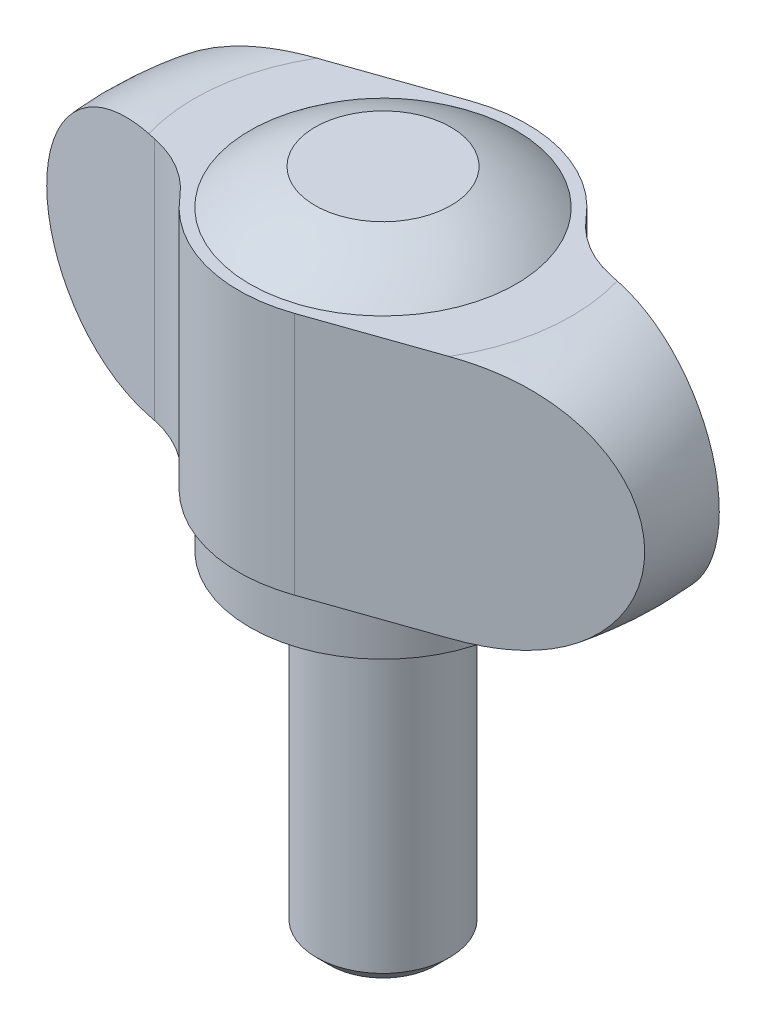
ISO-10303-21;
HEADER;
FILE_DESCRIPTION(('STEP AP214'),'2;1');
FILE_NAME('part.step','',(''),(''),'','','');
FILE_SCHEMA(('AUTOMOTIVE_DESIGN { 1 0 10303 214 1 1 1 1 }'));
ENDSEC;
DATA;
#1=APPLICATION_CONTEXT('core data for automotive mechanical design processes');
#2=APPLICATION_PROTOCOL_DEFINITION('international standard','automotive_design',2000,#1);
#3=PRODUCT_CONTEXT('',#1,'mechanical');
#4=PRODUCT('Part','Part','',(#3));
#5=PRODUCT_RELATED_PRODUCT_CATEGORY('part','',(#4));
#6=PRODUCT_DEFINITION_FORMATION('','',#4);
#7=PRODUCT_DEFINITION_CONTEXT('part definition',#1,'design');
#8=PRODUCT_DEFINITION('design','',#6,#7);
#9=PRODUCT_DEFINITION_SHAPE('','',#8);
#10=(LENGTH_UNIT() NAMED_UNIT(*) SI_UNIT(.MILLI.,.METRE.));
#11=(NAMED_UNIT(*) PLANE_ANGLE_UNIT() SI_UNIT($,.RADIAN.));
#12=(NAMED_UNIT(*) SI_UNIT($,.STERADIAN.) SOLID_ANGLE_UNIT());
#13=UNCERTAINTY_MEASURE_WITH_UNIT(LENGTH_MEASURE(1.E-05),#10,'distance_accuracy_value','');
#14=(GEOMETRIC_REPRESENTATION_CONTEXT(3) GLOBAL_UNCERTAINTY_ASSIGNED_CONTEXT((#13)) GLOBAL_UNIT_ASSIGNED_CONTEXT((#10,
#11,#12)) REPRESENTATION_CONTEXT('',''));
#15=CARTESIAN_POINT('',(0.,0.,0.));
#16=DIRECTION('',(0.,0.,1.));
#17=DIRECTION('',(1.,0.,0.));
#18=AXIS2_PLACEMENT_3D('',#15,#16,#17);
#19=CARTESIAN_POINT('',(0.,15.,0.));
#20=DIRECTION('',(0.,-1.,0.));
#21=DIRECTION('',(0.,0.,-1.));
#22=AXIS2_PLACEMENT_3D('',#19,#20,#21);
#23=PLANE('',#22);
#24=CARTESIAN_POINT('',(0.,15.,0.));
#25=DIRECTION('',(0.,-1.,0.));
#26=DIRECTION('',(0.,0.,-1.));
#27=AXIS2_PLACEMENT_3D('',#24,#25,#26);
#28=CIRCLE('',#27,3.06127891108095);
#29=CARTESIAN_POINT('',(0.,15.,-3.06127891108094));
#30=VERTEX_POINT('',#29);
#31=EDGE_CURVE('E21',#30,#30,#28,.T.);
#32=ORIENTED_EDGE('',*,*,#31,.F.);
#33=EDGE_LOOP('',(#32));
#34=FACE_BOUND('',#33,.T.);
#35=ADVANCED_FACE('F16',(#34),#23,.F.);
#36=CARTESIAN_POINT('',(0.,5.87857142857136,0.));
#37=DIRECTION('',(1.,0.,0.));
#38=DIRECTION('',(0.,0.776661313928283,-0.629918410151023));
#39=AXIS2_PLACEMENT_3D('',#36,#37,#38);
#40=SPHERICAL_SURFACE('',#39,9.62142857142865);
#41=CARTESIAN_POINT('',(0.,5.87857142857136,0.));
#42=DIRECTION('',(0.,-1.,0.));
#43=DIRECTION('',(0.,0.,-1.));
#44=AXIS2_PLACEMENT_3D('',#41,#42,#43);
#45=SPHERICAL_SURFACE('',#44,9.62142857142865);
#46=ORIENTED_EDGE('',*,*,#31,.T.);
#47=EDGE_LOOP('',(#46));
#48=FACE_BOUND('',#47,.T.);
#49=CARTESIAN_POINT('',(0.,13.4,0.));
#50=DIRECTION('',(0.,-1.,0.));
#51=DIRECTION('',(0.,0.,-1.));
#52=AXIS2_PLACEMENT_3D('',#49,#50,#51);
#53=CIRCLE('',#52,6.00000000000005);
#54=CARTESIAN_POINT('',(0.,13.4,-6.00000000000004));
#55=VERTEX_POINT('',#54);
#56=EDGE_CURVE('E114',#55,#55,#53,.F.);
#57=ORIENTED_EDGE('',*,*,#56,.T.);
#58=EDGE_LOOP('',(#57));
#59=FACE_BOUND('',#58,.T.);
#60=ADVANCED_FACE('F187',(#48,#59),#45,.T.);
#61=CARTESIAN_POINT('',(-14.,20.,1.2));
#62=DIRECTION('',(0.201762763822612,0.,-0.979434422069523));
#63=DIRECTION('',(-0.979434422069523,0.,-0.201762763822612));
#64=AXIS2_PLACEMENT_3D('',#61,#62,#63);
#65=PLANE('',#64);
#66=DIRECTION('',(0.,1.,0.));
#67=VECTOR('',#66,1.);
#68=CARTESIAN_POINT('',(-7.81873445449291,20.,2.47333611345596));
#69=LINE('',#68,#67);
#70=CARTESIAN_POINT('',(-7.81873445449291,2.39999999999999,2.47333611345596));
#71=VERTEX_POINT('',#70);
#72=CARTESIAN_POINT('',(-7.81873445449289,13.4,2.47333611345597));
#73=VERTEX_POINT('',#72);
#74=EDGE_CURVE('E132',#71,#73,#69,.T.);
#75=ORIENTED_EDGE('',*,*,#74,.T.);
#76=DIRECTION('',(-0.979434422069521,0.,-0.201762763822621));
#77=VECTOR('',#76,1.);
#78=CARTESIAN_POINT('',(-7.81873445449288,13.4,2.47333611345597));
#79=LINE('',#78,#77);
#80=CARTESIAN_POINT('',(-8.15280922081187,13.4,2.4045169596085));
#81=VERTEX_POINT('',#80);
#82=EDGE_CURVE('E113',#73,#81,#79,.T.);
#83=ORIENTED_EDGE('',*,*,#82,.T.);
#84=CARTESIAN_POINT('',(-8.15280922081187,2.4,2.4045169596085));
#85=CARTESIAN_POINT('',(-8.32890758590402,2.39997095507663,2.36824082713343));
#86=CARTESIAN_POINT('',(-8.50505324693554,2.40686424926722,2.33195495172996));
#87=CARTESIAN_POINT('',(-8.85634674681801,2.43495780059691,2.25958875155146));
#88=CARTESIAN_POINT('',(-9.03149391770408,2.45616670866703,2.22350856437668));
#89=CARTESIAN_POINT('',(-9.38017575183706,2.51346890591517,2.15168036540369));
#90=CARTESIAN_POINT('',(-9.55370120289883,2.54962119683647,2.11593425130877));
#91=CARTESIAN_POINT('',(-9.89703709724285,2.63704156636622,2.04520731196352));
#92=CARTESIAN_POINT('',(-10.0668482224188,2.68830684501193,2.01022634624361));
#93=CARTESIAN_POINT('',(-10.4048509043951,2.80723958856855,1.94059804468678));
#94=CARTESIAN_POINT('',(-10.5729350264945,2.87522650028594,1.90597284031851));
#95=CARTESIAN_POINT('',(-10.9021926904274,3.02684903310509,1.83814600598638));
#96=CARTESIAN_POINT('',(-11.063366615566,3.11048378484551,1.80494429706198));
#97=CARTESIAN_POINT('',(-11.3768919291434,3.29282968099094,1.74035831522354));
#98=CARTESIAN_POINT('',(-11.5292605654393,3.39150987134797,1.70897048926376));
#99=CARTESIAN_POINT('',(-11.8239293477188,3.60344897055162,1.64826893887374));
#100=CARTESIAN_POINT('',(-11.966230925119,3.7167058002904,1.61895491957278));
#101=CARTESIAN_POINT('',(-12.2245436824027,3.94402585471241,1.56574268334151));
#102=CARTESIAN_POINT('',(-12.3417364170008,4.05669245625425,1.54160106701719));
#103=CARTESIAN_POINT('',(-12.5658403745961,4.29221860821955,1.49543581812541));
#104=CARTESIAN_POINT('',(-12.6727525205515,4.41507724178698,1.47341199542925));
#105=CARTESIAN_POINT('',(-12.875382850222,4.67019439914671,1.43167029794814));
#106=CARTESIAN_POINT('',(-12.971094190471,4.80245859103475,1.41195383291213));
#107=CARTESIAN_POINT('',(-13.1503468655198,5.07531815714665,1.37502791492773));
#108=CARTESIAN_POINT('',(-13.233888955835,5.21591301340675,1.35781830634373));
#109=CARTESIAN_POINT('',(-13.3833301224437,5.49556809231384,1.32703353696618));
#110=CARTESIAN_POINT('',(-13.4499920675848,5.63420396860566,1.31330122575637));
#111=CARTESIAN_POINT('',(-13.5713060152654,5.91684392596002,1.2883106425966));
#112=CARTESIAN_POINT('',(-13.6259588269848,6.0608476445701,1.27705220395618));
#113=CARTESIAN_POINT('',(-13.7226918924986,6.35288469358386,1.25712526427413));
#114=CARTESIAN_POINT('',(-13.7647959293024,6.50090981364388,1.24845186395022));
#115=CARTESIAN_POINT('',(-13.8361905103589,6.80008784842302,1.23374463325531));
#116=CARTESIAN_POINT('',(-13.8654864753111,6.95123941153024,1.22770968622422));
#117=CARTESIAN_POINT('',(-13.9079778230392,7.23514887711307,1.21895650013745));
#118=CARTESIAN_POINT('',(-13.9228056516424,7.36765475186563,1.21590197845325));
#119=CARTESIAN_POINT('',(-13.9425884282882,7.63343839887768,1.21182674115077));
#120=CARTESIAN_POINT('',(-13.9475430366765,7.76671619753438,1.21080609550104));
#121=CARTESIAN_POINT('',(-13.9475424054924,8.04913209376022,1.21080622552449));
#122=CARTESIAN_POINT('',(-13.9413387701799,8.19827170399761,1.21208416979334));
#123=CARTESIAN_POINT('',(-13.9165698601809,8.4955320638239,1.21718654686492));
#124=CARTESIAN_POINT('',(-13.8979996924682,8.64365238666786,1.22101198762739));
#125=CARTESIAN_POINT('',(-13.8486139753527,8.93795149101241,1.23118540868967));
#126=CARTESIAN_POINT('',(-13.8177822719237,9.08412744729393,1.23753671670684));
#127=CARTESIAN_POINT('',(-13.7441140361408,9.37334850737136,1.25271231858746));
#128=CARTESIAN_POINT('',(-13.7012729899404,9.51639241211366,1.26153754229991));
#129=CARTESIAN_POINT('',(-13.6040240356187,9.79804873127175,1.28157075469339));
#130=CARTESIAN_POINT('',(-13.5496356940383,9.9366681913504,1.29277471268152));
#131=CARTESIAN_POINT('',(-13.4296675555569,10.2088225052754,1.31748806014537));
#132=CARTESIAN_POINT('',(-13.3640836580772,10.3423554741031,1.33099829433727));
#133=CARTESIAN_POINT('',(-13.2223087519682,10.6033016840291,1.36020381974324));
#134=CARTESIAN_POINT('',(-13.1461245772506,10.7307187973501,1.37589770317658));
#135=CARTESIAN_POINT('',(-12.9836891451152,10.9787400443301,1.40935928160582));
#136=CARTESIAN_POINT('',(-12.8974343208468,11.0993417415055,1.42712771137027));
#137=CARTESIAN_POINT('',(-12.7144110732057,11.3343890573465,1.46483036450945));
#138=CARTESIAN_POINT('',(-12.617524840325,11.448739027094,1.48478885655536));
#139=CARTESIAN_POINT('',(-12.4148906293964,11.6689396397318,1.52653135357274));
#140=CARTESIAN_POINT('',(-12.3091423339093,11.774789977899,1.54831542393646));
#141=CARTESIAN_POINT('',(-12.0895944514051,11.9773811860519,1.59354212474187));
#142=CARTESIAN_POINT('',(-11.9757951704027,12.0741224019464,1.61698469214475));
#143=CARTESIAN_POINT('',(-11.7410175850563,12.2579691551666,1.66534870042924));
#144=CARTESIAN_POINT('',(-11.6200412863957,12.3450773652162,1.69026972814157));
#145=CARTESIAN_POINT('',(-11.3670538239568,12.5123896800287,1.74238495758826));
#146=CARTESIAN_POINT('',(-11.2347984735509,12.592208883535,1.76962946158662));
#147=CARTESIAN_POINT('',(-10.9644781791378,12.7407151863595,1.82531524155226));
#148=CARTESIAN_POINT('',(-10.8264148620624,12.8094053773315,1.85375618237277));
#149=CARTESIAN_POINT('',(-10.5452531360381,12.9355459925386,1.91167528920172));
#150=CARTESIAN_POINT('',(-10.402148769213,12.9929825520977,1.94115468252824));
#151=CARTESIAN_POINT('',(-10.112076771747,13.0964001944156,2.00090929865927));
#152=CARTESIAN_POINT('',(-9.96511033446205,13.1423847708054,2.03118427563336));
#153=CARTESIAN_POINT('',(-9.68099065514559,13.2194752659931,2.08971271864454));
#154=CARTESIAN_POINT('',(-9.54408039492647,13.2515206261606,2.11791613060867));
#155=CARTESIAN_POINT('',(-9.26846219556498,13.3061775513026,2.17469327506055));
#156=CARTESIAN_POINT('',(-9.12975418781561,13.3287887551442,2.20326702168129));
#157=CARTESIAN_POINT('',(-8.85158886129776,13.3646898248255,2.26056887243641));
#158=CARTESIAN_POINT('',(-8.71213471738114,13.378005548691,2.28929632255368));
#159=CARTESIAN_POINT('',(-8.4327169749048,13.3956650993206,2.34685617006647));
#160=CARTESIAN_POINT('',(-8.2927535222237,13.4000113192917,2.37568853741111));
#161=CARTESIAN_POINT('',(-8.15280922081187,13.4,2.4045169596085));
#162=B_SPLINE_CURVE_WITH_KNOTS('',3,(#84,#85,#86,#87,#88,#89,#90,#91,#92,#93,#94,#95,#96,#97,
#98,#99,#100,#101,#102,#103,#104,#105,#106,#107,#108,#109,#110,#111,#112,#113,#114,#115,#116,
#117,#118,#119,#120,#121,#122,#123,#124,#125,#126,#127,#128,#129,#130,#131,#132,#133,#134,#135,
#136,#137,#138,#139,#140,#141,#142,#143,#144,#145,#146,#147,#148,#149,#150,#151,#152,#153,#154,
#155,#156,#157,#158,#159,#160,#161),.UNSPECIFIED.,.F.,.F.,(4,2,2,2,2,2,2,2,2,2,2,2,2,2,2,2,2,2,
2,2,2,2,2,2,2,2,2,2,2,2,2,2,2,2,2,2,2,2,4),(0.,0.539326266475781,1.07897874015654,
1.62078261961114,2.16248618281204,2.71547467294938,3.26843244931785,3.82026756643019,
4.37202406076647,4.86444235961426,5.35681640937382,5.84948973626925,6.34213246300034,
6.80488832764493,7.26761300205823,7.72945503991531,8.19110142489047,8.59083086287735,
8.99057405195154,9.43784924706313,9.88530151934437,10.3333452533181,10.781557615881,
11.229016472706,11.6766395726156,12.1239754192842,12.571470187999,13.0245515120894,
13.4776490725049,13.9307294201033,14.3836837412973,14.8537416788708,15.3236688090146,
15.7941713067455,16.2645300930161,16.6944394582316,17.1243652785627,17.5530903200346,
17.9817009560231),.UNSPECIFIED.);
#163=CARTESIAN_POINT('',(-8.15280922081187,2.4,2.4045169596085));
#164=VERTEX_POINT('',#163);
#165=EDGE_CURVE('E191',#164,#81,#162,.T.);
#166=ORIENTED_EDGE('',*,*,#165,.F.);
#167=DIRECTION('',(-0.979434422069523,0.,-0.201762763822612));
#168=VECTOR('',#167,1.);
#169=CARTESIAN_POINT('',(-14.,2.39999999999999,1.2));
#170=LINE('',#169,#168);
#171=EDGE_CURVE('E143',#71,#164,#170,.T.);
#172=ORIENTED_EDGE('',*,*,#171,.F.);
#173=EDGE_LOOP('',(#75,#83,#166,#172));
#174=FACE_BOUND('',#173,.T.);
#175=ADVANCED_FACE('F199',(#174),#65,.F.);
#176=CARTESIAN_POINT('',(14.,20.,-1.2));
#177=DIRECTION('',(-0.201762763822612,0.,0.979434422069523));
#178=DIRECTION('',(0.979434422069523,0.,0.201762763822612));
#179=AXIS2_PLACEMENT_3D('',#176,#177,#178);
#180=PLANE('',#179);
#181=DIRECTION('',(0.,1.,0.));
#182=VECTOR('',#181,1.);
#183=CARTESIAN_POINT('',(7.81873445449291,20.,-2.47333611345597));
#184=LINE('',#183,#182);
#185=CARTESIAN_POINT('',(7.81873445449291,2.39999999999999,-2.47333611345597));
#186=VERTEX_POINT('',#185);
#187=CARTESIAN_POINT('',(7.81873445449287,13.4,-2.47333611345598));
#188=VERTEX_POINT('',#187);
#189=EDGE_CURVE('E126',#186,#188,#184,.T.);
#190=ORIENTED_EDGE('',*,*,#189,.T.);
#191=DIRECTION('',(0.97943442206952,0.,0.201762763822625));
#192=VECTOR('',#191,1.);
#193=CARTESIAN_POINT('',(7.81873445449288,13.4,-2.47333611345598));
#194=LINE('',#193,#192);
#195=CARTESIAN_POINT('',(8.15280922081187,13.4,-2.4045169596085));
#196=VERTEX_POINT('',#195);
#197=EDGE_CURVE('E136',#188,#196,#194,.T.);
#198=ORIENTED_EDGE('',*,*,#197,.T.);
#199=CARTESIAN_POINT('',(8.15280922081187,2.4,-2.4045169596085));
#200=CARTESIAN_POINT('',(8.32890758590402,2.39997095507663,-2.36824082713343));
#201=CARTESIAN_POINT('',(8.50505324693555,2.40686424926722,-2.33195495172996));
#202=CARTESIAN_POINT('',(8.85634674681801,2.43495780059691,-2.25958875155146));
#203=CARTESIAN_POINT('',(9.03149391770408,2.45616670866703,-2.22350856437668));
#204=CARTESIAN_POINT('',(9.38017575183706,2.51346890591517,-2.15168036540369));
#205=CARTESIAN_POINT('',(9.55370120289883,2.54962119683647,-2.11593425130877));
#206=CARTESIAN_POINT('',(9.89703709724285,2.63704156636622,-2.04520731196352));
#207=CARTESIAN_POINT('',(10.0668482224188,2.68830684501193,-2.01022634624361));
#208=CARTESIAN_POINT('',(10.4048509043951,2.80723958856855,-1.94059804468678));
#209=CARTESIAN_POINT('',(10.5729350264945,2.87522650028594,-1.90597284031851));
#210=CARTESIAN_POINT('',(10.9021926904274,3.02684903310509,-1.83814600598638));
#211=CARTESIAN_POINT('',(11.063366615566,3.11048378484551,-1.80494429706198));
#212=CARTESIAN_POINT('',(11.3768919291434,3.29282968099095,-1.74035831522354));
#213=CARTESIAN_POINT('',(11.5292605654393,3.39150987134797,-1.70897048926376));
#214=CARTESIAN_POINT('',(11.8239293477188,3.60344897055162,-1.64826893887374));
#215=CARTESIAN_POINT('',(11.966230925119,3.7167058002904,-1.61895491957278));
#216=CARTESIAN_POINT('',(12.2245436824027,3.9440258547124,-1.56574268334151));
#217=CARTESIAN_POINT('',(12.3417364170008,4.05669245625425,-1.54160106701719));
#218=CARTESIAN_POINT('',(12.5658403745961,4.29221860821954,-1.49543581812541));
#219=CARTESIAN_POINT('',(12.6727525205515,4.41507724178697,-1.47341199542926));
#220=CARTESIAN_POINT('',(12.875382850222,4.67019439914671,-1.43167029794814));
#221=CARTESIAN_POINT('',(12.971094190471,4.80245859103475,-1.41195383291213));
#222=CARTESIAN_POINT('',(13.1503468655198,5.07531815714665,-1.37502791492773));
#223=CARTESIAN_POINT('',(13.233888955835,5.21591301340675,-1.35781830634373));
#224=CARTESIAN_POINT('',(13.3833301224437,5.49556809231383,-1.32703353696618));
#225=CARTESIAN_POINT('',(13.4499920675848,5.63420396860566,-1.31330122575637));
#226=CARTESIAN_POINT('',(13.5713060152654,5.91684392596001,-1.2883106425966));
#227=CARTESIAN_POINT('',(13.6259588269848,6.0608476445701,-1.27705220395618));
#228=CARTESIAN_POINT('',(13.7226918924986,6.35288469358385,-1.25712526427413));
#229=CARTESIAN_POINT('',(13.7647959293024,6.50090981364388,-1.24845186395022));
#230=CARTESIAN_POINT('',(13.8361905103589,6.80008784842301,-1.23374463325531));
#231=CARTESIAN_POINT('',(13.8654864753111,6.95123941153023,-1.22770968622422));
#232=CARTESIAN_POINT('',(13.9079778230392,7.23514887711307,-1.21895650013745));
#233=CARTESIAN_POINT('',(13.9228056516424,7.36765475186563,-1.21590197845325));
#234=CARTESIAN_POINT('',(13.9425884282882,7.63343839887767,-1.21182674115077));
#235=CARTESIAN_POINT('',(13.9475430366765,7.76671619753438,-1.21080609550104));
#236=CARTESIAN_POINT('',(13.9475424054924,8.04913209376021,-1.21080622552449));
#237=CARTESIAN_POINT('',(13.9413387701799,8.19827170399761,-1.21208416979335));
#238=CARTESIAN_POINT('',(13.9165698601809,8.4955320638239,-1.21718654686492));
#239=CARTESIAN_POINT('',(13.8979996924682,8.64365238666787,-1.2210119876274));
#240=CARTESIAN_POINT('',(13.8486139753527,8.93795149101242,-1.23118540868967));
#241=CARTESIAN_POINT('',(13.8177822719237,9.08412744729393,-1.23753671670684));
#242=CARTESIAN_POINT('',(13.7441140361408,9.37334850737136,-1.25271231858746));
#243=CARTESIAN_POINT('',(13.7012729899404,9.51639241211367,-1.26153754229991));
#244=CARTESIAN_POINT('',(13.6040240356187,9.79804873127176,-1.28157075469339));
#245=CARTESIAN_POINT('',(13.5496356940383,9.9366681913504,-1.29277471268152));
#246=CARTESIAN_POINT('',(13.4296675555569,10.2088225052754,-1.31748806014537));
#247=CARTESIAN_POINT('',(13.3640836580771,10.3423554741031,-1.33099829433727));
#248=CARTESIAN_POINT('',(13.2223087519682,10.6033016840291,-1.36020381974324));
#249=CARTESIAN_POINT('',(13.1461245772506,10.7307187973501,-1.37589770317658));
#250=CARTESIAN_POINT('',(12.9836891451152,10.9787400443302,-1.40935928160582));
#251=CARTESIAN_POINT('',(12.8974343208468,11.0993417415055,-1.42712771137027));
#252=CARTESIAN_POINT('',(12.7144110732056,11.3343890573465,-1.46483036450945));
#253=CARTESIAN_POINT('',(12.617524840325,11.448739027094,-1.48478885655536));
#254=CARTESIAN_POINT('',(12.4148906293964,11.6689396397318,-1.52653135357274));
#255=CARTESIAN_POINT('',(12.3091423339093,11.774789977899,-1.54831542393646));
#256=CARTESIAN_POINT('',(12.0895944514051,11.9773811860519,-1.59354212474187));
#257=CARTESIAN_POINT('',(11.9757951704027,12.0741224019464,-1.61698469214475));
#258=CARTESIAN_POINT('',(11.7410175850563,12.2579691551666,-1.66534870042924));
#259=CARTESIAN_POINT('',(11.6200412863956,12.3450773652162,-1.69026972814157));
#260=CARTESIAN_POINT('',(11.3670538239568,12.5123896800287,-1.74238495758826));
#261=CARTESIAN_POINT('',(11.2347984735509,12.592208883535,-1.76962946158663));
#262=CARTESIAN_POINT('',(10.9644781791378,12.7407151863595,-1.82531524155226));
#263=CARTESIAN_POINT('',(10.8264148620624,12.8094053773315,-1.85375618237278));
#264=CARTESIAN_POINT('',(10.5452531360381,12.9355459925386,-1.91167528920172));
#265=CARTESIAN_POINT('',(10.402148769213,12.9929825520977,-1.94115468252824));
#266=CARTESIAN_POINT('',(10.112076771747,13.0964001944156,-2.00090929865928));
#267=CARTESIAN_POINT('',(9.96511033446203,13.1423847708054,-2.03118427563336));
#268=CARTESIAN_POINT('',(9.68099065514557,13.2194752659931,-2.08971271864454));
#269=CARTESIAN_POINT('',(9.54408039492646,13.2515206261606,-2.11791613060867));
#270=CARTESIAN_POINT('',(9.26846219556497,13.3061775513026,-2.17469327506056));
#271=CARTESIAN_POINT('',(9.1297541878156,13.3287887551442,-2.20326702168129));
#272=CARTESIAN_POINT('',(8.85158886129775,13.3646898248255,-2.26056887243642));
#273=CARTESIAN_POINT('',(8.71213471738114,13.378005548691,-2.28929632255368));
#274=CARTESIAN_POINT('',(8.4327169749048,13.3956650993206,-2.34685617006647));
#275=CARTESIAN_POINT('',(8.2927535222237,13.4000113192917,-2.37568853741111));
#276=CARTESIAN_POINT('',(8.15280922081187,13.4,-2.4045169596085));
#277=B_SPLINE_CURVE_WITH_KNOTS('',3,(#199,#200,#201,#202,#203,#204,#205,#206,#207,#208,#209,
#210,#211,#212,#213,#214,#215,#216,#217,#218,#219,#220,#221,#222,#223,#224,#225,#226,#227,#228,
#229,#230,#231,#232,#233,#234,#235,#236,#237,#238,#239,#240,#241,#242,#243,#244,#245,#246,#247,
#248,#249,#250,#251,#252,#253,#254,#255,#256,#257,#258,#259,#260,#261,#262,#263,#264,#265,#266,
#267,#268,#269,#270,#271,#272,#273,#274,#275,#276),.UNSPECIFIED.,.F.,.F.,(4,2,2,2,2,2,2,2,2,2,2,
2,2,2,2,2,2,2,2,2,2,2,2,2,2,2,2,2,2,2,2,2,2,2,2,2,2,2,4),(0.,0.539326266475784,1.07897874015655,
1.62078261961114,2.16248618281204,2.71547467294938,3.26843244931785,3.82026756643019,
4.37202406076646,4.86444235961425,5.35681640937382,5.84948973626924,6.34213246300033,
6.80488832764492,7.26761300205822,7.7294550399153,8.19110142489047,8.59083086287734,
8.99057405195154,9.43784924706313,9.88530151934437,10.3333452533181,10.781557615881,
11.229016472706,11.6766395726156,12.1239754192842,12.571470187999,13.0245515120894,
13.4776490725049,13.9307294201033,14.3836837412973,14.8537416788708,15.3236688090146,
15.7941713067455,16.2645300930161,16.6944394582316,17.1243652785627,17.5530903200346,
17.981700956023),.UNSPECIFIED.);
#278=CARTESIAN_POINT('',(8.15280922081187,2.4,-2.4045169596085));
#279=VERTEX_POINT('',#278);
#280=EDGE_CURVE('E105',#279,#196,#277,.T.);
#281=ORIENTED_EDGE('',*,*,#280,.F.);
#282=DIRECTION('',(0.979434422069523,0.,0.201762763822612));
#283=VECTOR('',#282,1.);
#284=CARTESIAN_POINT('',(14.,2.39999999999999,-1.2));
#285=LINE('',#284,#283);
#286=EDGE_CURVE('E141',#186,#279,#285,.T.);
#287=ORIENTED_EDGE('',*,*,#286,.F.);
#288=EDGE_LOOP('',(#190,#198,#281,#287));
#289=FACE_BOUND('',#288,.T.);
#290=ADVANCED_FACE('F203',(#289),#180,.F.);
#291=CARTESIAN_POINT('',(6.00000000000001,13.4,0.));
#292=DIRECTION('',(0.,-1.,0.));
#293=DIRECTION('',(0.,0.,-1.));
#294=AXIS2_PLACEMENT_3D('',#291,#292,#293);
#295=PLANE('',#294);
#296=CARTESIAN_POINT('',(8.82754827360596,13.4,-7.37050822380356));
#297=DIRECTION('',(0.,1.,0.));
#298=DIRECTION('',(0.,0.,1.));
#299=AXIS2_PLACEMENT_3D('',#296,#297,#298);
#300=CIRCLE('',#299,4.99999999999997);
#301=CARTESIAN_POINT('',(4.98948380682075,13.4,-4.16593943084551));
#302=VERTEX_POINT('',#301);
#303=EDGE_CURVE('E104',#188,#302,#300,.F.);
#304=ORIENTED_EDGE('',*,*,#303,.T.);
#305=CARTESIAN_POINT('',(0.,13.4,0.));
#306=DIRECTION('',(0.,1.,0.));
#307=DIRECTION('',(0.,0.,1.));
#308=AXIS2_PLACEMENT_3D('',#305,#306,#307);
#309=CIRCLE('',#308,6.49999999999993);
#310=CARTESIAN_POINT('',(-2.14110931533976,13.4,-6.13723479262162));
#311=VERTEX_POINT('',#310);
#312=EDGE_CURVE('E175',#311,#302,#309,.F.);
#313=ORIENTED_EDGE('',*,*,#312,.F.);
#314=DIRECTION('',(0.944189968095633,0.,-0.329401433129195));
#315=VECTOR('',#314,1.);
#316=CARTESIAN_POINT('',(-2.14110931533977,13.4,-6.13723479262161));
#317=LINE('',#316,#315);
#318=CARTESIAN_POINT('',(-7.31265075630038,13.4,-4.33302883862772));
#319=VERTEX_POINT('',#318);
#320=EDGE_CURVE('E174',#311,#319,#317,.F.);
#321=ORIENTED_EDGE('',*,*,#320,.T.);
#322=CARTESIAN_POINT('',(0.,13.4,0.));
#323=DIRECTION('',(0.,-1.,0.));
#324=DIRECTION('',(0.,0.,-1.));
#325=AXIS2_PLACEMENT_3D('',#322,#323,#324);
#326=CIRCLE('',#325,8.5);
#327=EDGE_CURVE('E138',#81,#319,#326,.T.);
#328=ORIENTED_EDGE('',*,*,#327,.F.);
#329=ORIENTED_EDGE('',*,*,#82,.F.);
#330=CARTESIAN_POINT('',(-8.82754827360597,13.4,7.37050822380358));
#331=DIRECTION('',(0.,1.,0.));
#332=DIRECTION('',(0.,0.,1.));
#333=AXIS2_PLACEMENT_3D('',#330,#331,#332);
#334=CIRCLE('',#333,5.);
#335=CARTESIAN_POINT('',(-4.98948380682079,13.4,4.1659394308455));
#336=VERTEX_POINT('',#335);
#337=EDGE_CURVE('E135',#73,#336,#334,.F.);
#338=ORIENTED_EDGE('',*,*,#337,.T.);
#339=CARTESIAN_POINT('',(0.,13.4,0.));
#340=DIRECTION('',(0.,1.,0.));
#341=DIRECTION('',(0.,0.,1.));
#342=AXIS2_PLACEMENT_3D('',#339,#340,#341);
#343=CIRCLE('',#342,6.50000000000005);
#344=CARTESIAN_POINT('',(2.14110931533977,13.4,6.13723479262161));
#345=VERTEX_POINT('',#344);
#346=EDGE_CURVE('E119',#345,#336,#343,.F.);
#347=ORIENTED_EDGE('',*,*,#346,.F.);
#348=DIRECTION('',(-0.944189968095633,0.,0.329401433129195));
#349=VECTOR('',#348,1.);
#350=CARTESIAN_POINT('',(2.14110931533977,13.4,6.13723479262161));
#351=LINE('',#350,#349);
#352=CARTESIAN_POINT('',(7.31265075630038,13.4,4.33302883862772));
#353=VERTEX_POINT('',#352);
#354=EDGE_CURVE('E98',#345,#353,#351,.F.);
#355=ORIENTED_EDGE('',*,*,#354,.T.);
#356=CARTESIAN_POINT('',(0.,13.4,0.));
#357=DIRECTION('',(0.,-1.,0.));
#358=DIRECTION('',(0.,0.,-1.));
#359=AXIS2_PLACEMENT_3D('',#356,#357,#358);
#360=CIRCLE('',#359,8.49999999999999);
#361=EDGE_CURVE('E109',#196,#353,#360,.T.);
#362=ORIENTED_EDGE('',*,*,#361,.F.);
#363=ORIENTED_EDGE('',*,*,#197,.F.);
#364=EDGE_LOOP('',(#304,#313,#321,#328,#329,#338,#347,#355,#362,#363));
#365=FACE_BOUND('',#364,.T.);
#366=ORIENTED_EDGE('',*,*,#56,.F.);
#367=EDGE_LOOP('',(#366));
#368=FACE_BOUND('',#367,.T.);
#369=ADVANCED_FACE('F116',(#365,#368),#295,.F.);
#370=CARTESIAN_POINT('',(0.,7.9,0.));
#371=DIRECTION('',(0.,-1.,0.));
#372=DIRECTION('',(0.,0.,-1.));
#373=AXIS2_PLACEMENT_3D('',#370,#371,#372);
#374=TOROIDAL_SURFACE('',#373,8.49999999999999,5.5);
#375=CARTESIAN_POINT('',(-7.31265075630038,13.4,-4.33302883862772));
#376=CARTESIAN_POINT('',(-7.44554591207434,13.4000031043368,-4.28666544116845));
#377=CARTESIAN_POINT('',(-7.57844074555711,13.3977552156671,-4.24030215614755));
#378=CARTESIAN_POINT('',(-7.84412202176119,13.3881849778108,-4.14761340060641));
#379=CARTESIAN_POINT('',(-7.97690839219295,13.3808604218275,-4.10128795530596));
#380=CARTESIAN_POINT('',(-8.37585784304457,13.3503315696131,-3.9621056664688));
#381=CARTESIAN_POINT('',(-8.64151740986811,13.3185624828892,-3.86942448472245));
#382=CARTESIAN_POINT('',(-9.17128231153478,13.22784118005,-3.68460434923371));
#383=CARTESIAN_POINT('',(-9.43535033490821,13.1686393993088,-3.592478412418));
#384=CARTESIAN_POINT('',(-9.95537368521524,13.0197792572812,-3.411056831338));
#385=CARTESIAN_POINT('',(-10.2113442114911,12.9301821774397,-3.32175588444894));
#386=CARTESIAN_POINT('',(-10.6089106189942,12.7616223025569,-3.18305610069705));
#387=CARTESIAN_POINT('',(-10.7545543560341,12.6932401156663,-3.13224508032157));
#388=CARTESIAN_POINT('',(-11.0404790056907,12.5447817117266,-3.03249397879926));
#389=CARTESIAN_POINT('',(-11.1807595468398,12.4647046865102,-2.98355402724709));
#390=CARTESIAN_POINT('',(-11.4542283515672,12.2931036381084,-2.88814842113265));
#391=CARTESIAN_POINT('',(-11.5874414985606,12.2016241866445,-2.84167408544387));
#392=CARTESIAN_POINT('',(-11.846119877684,12.0070880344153,-2.75142844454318));
#393=CARTESIAN_POINT('',(-11.9715853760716,11.9040317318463,-2.70765704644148));
#394=CARTESIAN_POINT('',(-12.2144656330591,11.6857874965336,-2.62292292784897));
#395=CARTESIAN_POINT('',(-12.3318088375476,11.5705100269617,-2.58198517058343));
#396=CARTESIAN_POINT('',(-12.5560316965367,11.3290542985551,-2.50376009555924));
#397=CARTESIAN_POINT('',(-12.662912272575,11.2028770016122,-2.46647245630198));
#398=CARTESIAN_POINT('',(-12.865075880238,10.9402165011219,-2.39594323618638));
#399=CARTESIAN_POINT('',(-12.9603440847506,10.8037204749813,-2.36270682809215));
#400=CARTESIAN_POINT('',(-13.1379043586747,10.5215761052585,-2.30076102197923));
#401=CARTESIAN_POINT('',(-13.2201984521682,10.3759291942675,-2.27205091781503));
#402=CARTESIAN_POINT('',(-13.3630089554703,10.0920333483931,-2.22222833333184));
#403=CARTESIAN_POINT('',(-13.4248925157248,9.95455422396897,-2.20063889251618));
#404=CARTESIAN_POINT('',(-13.5366341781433,9.67422681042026,-2.16165535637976));
#405=CARTESIAN_POINT('',(-13.5864938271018,9.53137921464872,-2.14426072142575));
#406=CARTESIAN_POINT('',(-13.6735058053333,9.24180549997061,-2.11390467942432));
#407=CARTESIAN_POINT('',(-13.7106899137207,9.0950900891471,-2.10093218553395));
#408=CARTESIAN_POINT('',(-13.772069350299,8.798709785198,-2.0795186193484));
#409=CARTESIAN_POINT('',(-13.7962720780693,8.64904662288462,-2.07107496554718));
#410=CARTESIAN_POINT('',(-13.8254422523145,8.39928534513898,-2.06089830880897));
#411=CARTESIAN_POINT('',(-13.8341531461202,8.29966049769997,-2.05785932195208));
#412=CARTESIAN_POINT('',(-13.8457744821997,8.10002713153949,-2.05380496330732));
#413=CARTESIAN_POINT('',(-13.8486847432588,8.00001860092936,-2.05278965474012));
#414=CARTESIAN_POINT('',(-13.8486834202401,7.76007282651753,-2.05279011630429));
#415=CARTESIAN_POINT('',(-13.8429855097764,7.62012594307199,-2.05477795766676));
#416=CARTESIAN_POINT('',(-13.8202455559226,7.34121449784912,-2.06271129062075));
#417=CARTESIAN_POINT('',(-13.8031981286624,7.2022504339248,-2.06865866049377));
#418=CARTESIAN_POINT('',(-13.7578953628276,6.92616694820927,-2.08446352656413));
#419=CARTESIAN_POINT('',(-13.7296229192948,6.78905067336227,-2.0943269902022));
#420=CARTESIAN_POINT('',(-13.6621451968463,6.51781631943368,-2.11786807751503));
#421=CARTESIAN_POINT('',(-13.6229356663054,6.38369942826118,-2.1315471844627));
#422=CARTESIAN_POINT('',(-13.5341067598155,6.1198215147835,-2.16253710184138));
#423=CARTESIAN_POINT('',(-13.4845171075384,5.99004925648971,-2.17983754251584));
#424=CARTESIAN_POINT('',(-13.3753225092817,5.73526708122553,-2.21793247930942));
#425=CARTESIAN_POINT('',(-13.3157138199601,5.61025896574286,-2.23872828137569));
#426=CARTESIAN_POINT('',(-13.1870930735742,5.36589488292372,-2.28360045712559));
#427=CARTESIAN_POINT('',(-13.118086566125,5.24653563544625,-2.30767489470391));
#428=CARTESIAN_POINT('',(-12.9712426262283,5.01402016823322,-2.35890463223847));
#429=CARTESIAN_POINT('',(-12.8934019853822,4.90086622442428,-2.38606105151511));
#430=CARTESIAN_POINT('',(-12.7271097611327,4.67806194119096,-2.44407575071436));
#431=CARTESIAN_POINT('',(-12.6384087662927,4.56862053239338,-2.47502104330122));
#432=CARTESIAN_POINT('',(-12.4531111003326,4.35743948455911,-2.53966620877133));
#433=CARTESIAN_POINT('',(-12.3565111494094,4.25570307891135,-2.57336722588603));
#434=CARTESIAN_POINT('',(-12.1563236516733,4.06044383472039,-2.64320703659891));
#435=CARTESIAN_POINT('',(-12.0527416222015,3.9669146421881,-2.67934390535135));
#436=CARTESIAN_POINT('',(-11.8393161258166,3.78823990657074,-2.75380208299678));
#437=CARTESIAN_POINT('',(-11.7294720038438,3.7030952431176,-2.79212362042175));
#438=CARTESIAN_POINT('',(-11.4935216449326,3.53359472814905,-2.87444009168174));
#439=CARTESIAN_POINT('',(-11.366865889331,3.45009687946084,-2.91862673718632));
#440=CARTESIAN_POINT('',(-11.1079949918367,3.29341272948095,-3.00893954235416));
#441=CARTESIAN_POINT('',(-10.9757793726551,3.22022731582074,-3.05506586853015));
#442=CARTESIAN_POINT('',(-10.7063577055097,3.08388075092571,-3.14905954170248));
#443=CARTESIAN_POINT('',(-10.5691383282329,3.02074920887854,-3.19693153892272));
#444=CARTESIAN_POINT('',(-10.290951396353,2.90452744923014,-3.29398316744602));
#445=CARTESIAN_POINT('',(-10.1499830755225,2.85143930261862,-3.34316306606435));
#446=CARTESIAN_POINT('',(-9.78984247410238,2.72948158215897,-3.46880603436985));
#447=CARTESIAN_POINT('',(-9.56869723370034,2.66709038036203,-3.54595741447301));
#448=CARTESIAN_POINT('',(-9.12190340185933,2.56324549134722,-3.70183126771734));
#449=CARTESIAN_POINT('',(-8.8962498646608,2.52181627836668,-3.7805554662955));
#450=CARTESIAN_POINT('',(-8.44436246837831,2.45802313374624,-3.93820632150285));
#451=CARTESIAN_POINT('',(-8.21814644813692,2.43551489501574,-4.01712675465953));
#452=CARTESIAN_POINT('',(-7.87850471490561,2.41376012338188,-4.13561824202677));
#453=CARTESIAN_POINT('',(-7.76537759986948,2.4085089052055,-4.17508512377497));
#454=CARTESIAN_POINT('',(-7.53905088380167,2.40162841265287,-4.2540441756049));
#455=CARTESIAN_POINT('',(-7.4258513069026,2.39999826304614,-4.29353633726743));
#456=CARTESIAN_POINT('',(-7.31265075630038,2.4,-4.33302883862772));
#457=B_SPLINE_CURVE_WITH_KNOTS('',3,(#375,#376,#377,#378,#379,#380,#381,#382,#383,#384,#385,
#386,#387,#388,#389,#390,#391,#392,#393,#394,#395,#396,#397,#398,#399,#400,#401,#402,#403,#404,
#405,#406,#407,#408,#409,#410,#411,#412,#413,#414,#415,#416,#417,#418,#419,#420,#421,#422,#423,
#424,#425,#426,#427,#428,#429,#430,#431,#432,#433,#434,#435,#436,#437,#438,#439,#440,#441,#442,
#443,#444,#445,#446,#447,#448,#449,#450,#451,#452,#453,#454,#455,#456),.UNSPECIFIED.,.F.,.F.,(4,
2,2,2,2,2,2,2,2,2,2,2,2,2,2,2,2,2,2,2,2,2,2,2,2,2,2,2,2,2,2,2,2,2,2,2,2,2,2,2,4),(0.,
0.422221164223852,0.844625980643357,1.69290221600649,2.54905176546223,3.40348534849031,
3.90924564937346,4.41504091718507,4.91891765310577,5.42277706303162,5.93062313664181,
6.43842443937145,6.94686747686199,7.45523111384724,7.9115350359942,8.36778022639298,
8.8228729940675,9.27770607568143,9.57768428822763,9.87767187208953,10.2973579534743,
10.7172432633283,11.1377708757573,11.5584621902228,11.9779649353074,12.3976247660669,
12.8170378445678,13.236603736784,13.6688373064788,14.1012512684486,14.5333274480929,
14.96544890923,15.4389930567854,15.9125779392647,16.3875327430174,16.8625853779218,
17.5885936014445,18.3154475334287,19.0367062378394,19.3964491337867,19.7561050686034),.UNSPECIFIED.);
#458=CARTESIAN_POINT('',(-7.31265075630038,2.4,-4.33302883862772));
#459=VERTEX_POINT('',#458);
#460=EDGE_CURVE('E168',#319,#459,#457,.T.);
#461=ORIENTED_EDGE('',*,*,#460,.T.);
#462=CARTESIAN_POINT('',(0.,2.4,0.));
#463=DIRECTION('',(0.,-1.,0.));
#464=DIRECTION('',(0.,0.,-1.));
#465=AXIS2_PLACEMENT_3D('',#462,#463,#464);
#466=CIRCLE('',#465,8.49999999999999);
#467=EDGE_CURVE('E165',#459,#164,#466,.F.);
#468=ORIENTED_EDGE('',*,*,#467,.T.);
#469=ORIENTED_EDGE('',*,*,#165,.T.);
#470=ORIENTED_EDGE('',*,*,#327,.T.);
#471=EDGE_LOOP('',(#461,#468,#469,#470));
#472=FACE_BOUND('',#471,.T.);
#473=ADVANCED_FACE('F181',(#472),#374,.T.);
#474=CARTESIAN_POINT('',(-8.82754827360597,20.,7.37050822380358));
#475=DIRECTION('',(0.,1.,0.));
#476=DIRECTION('',(0.,0.,1.));
#477=AXIS2_PLACEMENT_3D('',#474,#475,#476);
#478=CYLINDRICAL_SURFACE('',#477,5.);
#479=CARTESIAN_POINT('',(-8.82754827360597,2.4,7.37050822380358));
#480=DIRECTION('',(0.,1.,0.));
#481=DIRECTION('',(0.,0.,1.));
#482=AXIS2_PLACEMENT_3D('',#479,#480,#481);
#483=CIRCLE('',#482,5.);
#484=CARTESIAN_POINT('',(-4.98948380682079,2.4,4.1659394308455));
#485=VERTEX_POINT('',#484);
#486=EDGE_CURVE('E162',#71,#485,#483,.F.);
#487=ORIENTED_EDGE('',*,*,#486,.T.);
#488=DIRECTION('',(0.,1.,0.));
#489=VECTOR('',#488,1.);
#490=CARTESIAN_POINT('',(-4.9894838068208,20.,4.16593943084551));
#491=LINE('',#490,#489);
#492=EDGE_CURVE('E129',#336,#485,#491,.F.);
#493=ORIENTED_EDGE('',*,*,#492,.F.);
#494=ORIENTED_EDGE('',*,*,#337,.F.);
#495=ORIENTED_EDGE('',*,*,#74,.F.);
#496=EDGE_LOOP('',(#487,#493,#494,#495));
#497=FACE_BOUND('',#496,.T.);
#498=ADVANCED_FACE('F185',(#497),#478,.F.);
#499=CARTESIAN_POINT('',(0.,20.,0.));
#500=DIRECTION('',(0.,1.,0.));
#501=DIRECTION('',(0.,0.,1.));
#502=AXIS2_PLACEMENT_3D('',#499,#500,#501);
#503=CYLINDRICAL_SURFACE('',#502,6.50000000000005);
#504=DIRECTION('',(0.,1.,0.));
#505=VECTOR('',#504,1.);
#506=CARTESIAN_POINT('',(2.14110931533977,20.,6.13723479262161));
#507=LINE('',#506,#505);
#508=CARTESIAN_POINT('',(2.14110931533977,2.4,6.13723479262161));
#509=VERTEX_POINT('',#508);
#510=EDGE_CURVE('E121',#509,#345,#507,.T.);
#511=ORIENTED_EDGE('',*,*,#510,.T.);
#512=ORIENTED_EDGE('',*,*,#346,.T.);
#513=ORIENTED_EDGE('',*,*,#492,.T.);
#514=CARTESIAN_POINT('',(0.,2.4,0.));
#515=DIRECTION('',(0.,1.,0.));
#516=DIRECTION('',(0.,0.,1.));
#517=AXIS2_PLACEMENT_3D('',#514,#515,#516);
#518=CIRCLE('',#517,6.50000000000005);
#519=EDGE_CURVE('E160',#485,#509,#518,.T.);
#520=ORIENTED_EDGE('',*,*,#519,.T.);
#521=EDGE_LOOP('',(#511,#512,#513,#520));
#522=FACE_BOUND('',#521,.T.);
#523=ADVANCED_FACE('F278',(#522),#503,.T.);
#524=CARTESIAN_POINT('',(2.14110931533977,20.,6.13723479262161));
#525=DIRECTION('',(-0.329401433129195,0.,-0.944189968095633));
#526=DIRECTION('',(-0.944189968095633,0.,0.329401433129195));
#527=AXIS2_PLACEMENT_3D('',#524,#525,#526);
#528=PLANE('',#527);
#529=CARTESIAN_POINT('',(7.31265075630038,13.4,4.33302883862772));
#530=CARTESIAN_POINT('',(7.44554591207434,13.4000031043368,4.28666544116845));
#531=CARTESIAN_POINT('',(7.5784407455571,13.3977552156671,4.24030215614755));
#532=CARTESIAN_POINT('',(7.84412202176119,13.3881849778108,4.14761340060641));
#533=CARTESIAN_POINT('',(7.97690839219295,13.3808604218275,4.10128795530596));
#534=CARTESIAN_POINT('',(8.37585784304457,13.3503315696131,3.96210566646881));
#535=CARTESIAN_POINT('',(8.64151740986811,13.3185624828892,3.86942448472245));
#536=CARTESIAN_POINT('',(9.17128231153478,13.22784118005,3.68460434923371));
#537=CARTESIAN_POINT('',(9.43535033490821,13.1686393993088,3.592478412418));
#538=CARTESIAN_POINT('',(9.95537368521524,13.0197792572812,3.41105683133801));
#539=CARTESIAN_POINT('',(10.2113442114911,12.9301821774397,3.32175588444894));
#540=CARTESIAN_POINT('',(10.6089106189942,12.7616223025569,3.18305610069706));
#541=CARTESIAN_POINT('',(10.7545543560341,12.6932401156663,3.13224508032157));
#542=CARTESIAN_POINT('',(11.0404790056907,12.5447817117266,3.03249397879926));
#543=CARTESIAN_POINT('',(11.1807595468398,12.4647046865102,2.98355402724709));
#544=CARTESIAN_POINT('',(11.4542283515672,12.2931036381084,2.88814842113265));
#545=CARTESIAN_POINT('',(11.5874414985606,12.2016241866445,2.84167408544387));
#546=CARTESIAN_POINT('',(11.846119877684,12.0070880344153,2.75142844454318));
#547=CARTESIAN_POINT('',(11.9715853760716,11.9040317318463,2.70765704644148));
#548=CARTESIAN_POINT('',(12.2144656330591,11.6857874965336,2.62292292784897));
#549=CARTESIAN_POINT('',(12.3318088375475,11.5705100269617,2.58198517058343));
#550=CARTESIAN_POINT('',(12.5560316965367,11.3290542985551,2.50376009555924));
#551=CARTESIAN_POINT('',(12.662912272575,11.2028770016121,2.46647245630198));
#552=CARTESIAN_POINT('',(12.865075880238,10.9402165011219,2.39594323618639));
#553=CARTESIAN_POINT('',(12.9603440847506,10.8037204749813,2.36270682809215));
#554=CARTESIAN_POINT('',(13.1379043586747,10.5215761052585,2.30076102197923));
#555=CARTESIAN_POINT('',(13.2201984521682,10.3759291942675,2.27205091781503));
#556=CARTESIAN_POINT('',(13.3630089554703,10.0920333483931,2.22222833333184));
#557=CARTESIAN_POINT('',(13.4248925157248,9.95455422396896,2.20063889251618));
#558=CARTESIAN_POINT('',(13.5366341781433,9.67422681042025,2.16165535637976));
#559=CARTESIAN_POINT('',(13.5864938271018,9.53137921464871,2.14426072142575));
#560=CARTESIAN_POINT('',(13.6735058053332,9.24180549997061,2.11390467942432));
#561=CARTESIAN_POINT('',(13.7106899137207,9.09509008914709,2.10093218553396));
#562=CARTESIAN_POINT('',(13.772069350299,8.79870978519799,2.0795186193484));
#563=CARTESIAN_POINT('',(13.7962720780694,8.64904662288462,2.07107496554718));
#564=CARTESIAN_POINT('',(13.8254422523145,8.39928534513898,2.06089830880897));
#565=CARTESIAN_POINT('',(13.8341531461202,8.29966049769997,2.05785932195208));
#566=CARTESIAN_POINT('',(13.8457744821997,8.10002713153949,2.05380496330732));
#567=CARTESIAN_POINT('',(13.8486847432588,8.00001860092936,2.05278965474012));
#568=CARTESIAN_POINT('',(13.8486834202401,7.76007282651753,2.05279011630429));
#569=CARTESIAN_POINT('',(13.8429855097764,7.62012594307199,2.05477795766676));
#570=CARTESIAN_POINT('',(13.8202455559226,7.34121449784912,2.06271129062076));
#571=CARTESIAN_POINT('',(13.8031981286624,7.2022504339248,2.06865866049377));
#572=CARTESIAN_POINT('',(13.7578953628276,6.92616694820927,2.08446352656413));
#573=CARTESIAN_POINT('',(13.7296229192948,6.78905067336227,2.0943269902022));
#574=CARTESIAN_POINT('',(13.6621451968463,6.51781631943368,2.11786807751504));
#575=CARTESIAN_POINT('',(13.6229356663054,6.38369942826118,2.1315471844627));
#576=CARTESIAN_POINT('',(13.5341067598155,6.1198215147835,2.16253710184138));
#577=CARTESIAN_POINT('',(13.4845171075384,5.99004925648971,2.17983754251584));
#578=CARTESIAN_POINT('',(13.3753225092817,5.73526708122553,2.21793247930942));
#579=CARTESIAN_POINT('',(13.3157138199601,5.61025896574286,2.23872828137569));
#580=CARTESIAN_POINT('',(13.1870930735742,5.36589488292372,2.2836004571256));
#581=CARTESIAN_POINT('',(13.118086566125,5.24653563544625,2.30767489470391));
#582=CARTESIAN_POINT('',(12.9712426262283,5.01402016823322,2.35890463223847));
#583=CARTESIAN_POINT('',(12.8934019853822,4.90086622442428,2.38606105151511));
#584=CARTESIAN_POINT('',(12.7271097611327,4.67806194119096,2.44407575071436));
#585=CARTESIAN_POINT('',(12.6384087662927,4.56862053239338,2.47502104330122));
#586=CARTESIAN_POINT('',(12.4531111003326,4.35743948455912,2.53966620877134));
#587=CARTESIAN_POINT('',(12.3565111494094,4.25570307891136,2.57336722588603));
#588=CARTESIAN_POINT('',(12.1563236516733,4.06044383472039,2.64320703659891));
#589=CARTESIAN_POINT('',(12.0527416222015,3.9669146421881,2.67934390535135));
#590=CARTESIAN_POINT('',(11.8393161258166,3.78823990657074,2.75380208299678));
#591=CARTESIAN_POINT('',(11.7294720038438,3.7030952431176,2.79212362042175));
#592=CARTESIAN_POINT('',(11.4935216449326,3.53359472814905,2.87444009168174));
#593=CARTESIAN_POINT('',(11.366865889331,3.45009687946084,2.91862673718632));
#594=CARTESIAN_POINT('',(11.1079949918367,3.29341272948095,3.00893954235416));
#595=CARTESIAN_POINT('',(10.9757793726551,3.22022731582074,3.05506586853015));
#596=CARTESIAN_POINT('',(10.7063577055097,3.08388075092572,3.14905954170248));
#597=CARTESIAN_POINT('',(10.5691383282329,3.02074920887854,3.19693153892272));
#598=CARTESIAN_POINT('',(10.290951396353,2.90452744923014,3.29398316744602));
#599=CARTESIAN_POINT('',(10.1499830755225,2.85143930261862,3.34316306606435));
#600=CARTESIAN_POINT('',(9.78984247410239,2.72948158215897,3.46880603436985));
#601=CARTESIAN_POINT('',(9.56869723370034,2.66709038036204,3.54595741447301));
#602=CARTESIAN_POINT('',(9.12190340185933,2.56324549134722,3.70183126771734));
#603=CARTESIAN_POINT('',(8.8962498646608,2.52181627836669,3.7805554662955));
#604=CARTESIAN_POINT('',(8.44436246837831,2.45802313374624,3.93820632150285));
#605=CARTESIAN_POINT('',(8.21814644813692,2.43551489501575,4.01712675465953));
#606=CARTESIAN_POINT('',(7.87850471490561,2.41376012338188,4.13561824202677));
#607=CARTESIAN_POINT('',(7.76537759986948,2.40850890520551,4.17508512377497));
#608=CARTESIAN_POINT('',(7.53905088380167,2.40162841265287,4.2540441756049));
#609=CARTESIAN_POINT('',(7.4258513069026,2.39999826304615,4.29353633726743));
#610=CARTESIAN_POINT('',(7.31265075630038,2.4,4.33302883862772));
#611=B_SPLINE_CURVE_WITH_KNOTS('',3,(#529,#530,#531,#532,#533,#534,#535,#536,#537,#538,#539,
#540,#541,#542,#543,#544,#545,#546,#547,#548,#549,#550,#551,#552,#553,#554,#555,#556,#557,#558,
#559,#560,#561,#562,#563,#564,#565,#566,#567,#568,#569,#570,#571,#572,#573,#574,#575,#576,#577,
#578,#579,#580,#581,#582,#583,#584,#585,#586,#587,#588,#589,#590,#591,#592,#593,#594,#595,#596,
#597,#598,#599,#600,#601,#602,#603,#604,#605,#606,#607,#608,#609,#610),.UNSPECIFIED.,.F.,.F.,(4,
2,2,2,2,2,2,2,2,2,2,2,2,2,2,2,2,2,2,2,2,2,2,2,2,2,2,2,2,2,2,2,2,2,2,2,2,2,2,2,4),(0.,
0.422221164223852,0.844625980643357,1.69290221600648,2.54905176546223,3.40348534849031,
3.90924564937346,4.41504091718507,4.91891765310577,5.42277706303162,5.93062313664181,
6.43842443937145,6.94686747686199,7.45523111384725,7.91153503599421,8.36778022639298,
8.82287299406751,9.27770607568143,9.57768428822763,9.87767187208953,10.2973579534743,
10.7172432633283,11.1377708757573,11.5584621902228,11.9779649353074,12.3976247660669,
12.8170378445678,13.236603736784,13.6688373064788,14.1012512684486,14.5333274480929,
14.96544890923,15.4389930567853,15.9125779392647,16.3875327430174,16.8625853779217,
17.5885936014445,18.3154475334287,19.0367062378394,19.3964491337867,19.7561050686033),.UNSPECIFIED.);
#612=CARTESIAN_POINT('',(7.31265075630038,2.4,4.33302883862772));
#613=VERTEX_POINT('',#612);
#614=EDGE_CURVE('E93',#353,#613,#611,.T.);
#615=ORIENTED_EDGE('',*,*,#614,.F.);
#616=ORIENTED_EDGE('',*,*,#354,.F.);
#617=ORIENTED_EDGE('',*,*,#510,.F.);
#618=DIRECTION('',(0.944189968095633,0.,-0.329401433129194));
#619=VECTOR('',#618,1.);
#620=CARTESIAN_POINT('',(2.14110931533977,2.4,6.13723479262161));
#621=LINE('',#620,#619);
#622=EDGE_CURVE('E100',#509,#613,#621,.T.);
#623=ORIENTED_EDGE('',*,*,#622,.T.);
#624=EDGE_LOOP('',(#615,#616,#617,#623));
#625=FACE_BOUND('',#624,.T.);
#626=ADVANCED_FACE('F95',(#625),#528,.F.);
#627=CARTESIAN_POINT('',(0.,7.9,0.));
#628=DIRECTION('',(0.,-1.,0.));
#629=DIRECTION('',(0.,0.,-1.));
#630=AXIS2_PLACEMENT_3D('',#627,#628,#629);
#631=TOROIDAL_SURFACE('',#630,8.5,5.5);
#632=ORIENTED_EDGE('',*,*,#614,.T.);
#633=CARTESIAN_POINT('',(0.,2.4,0.));
#634=DIRECTION('',(0.,-1.,0.));
#635=DIRECTION('',(0.,0.,-1.));
#636=AXIS2_PLACEMENT_3D('',#633,#634,#635);
#637=CIRCLE('',#636,8.5);
#638=EDGE_CURVE('E158',#613,#279,#637,.F.);
#639=ORIENTED_EDGE('',*,*,#638,.T.);
#640=ORIENTED_EDGE('',*,*,#280,.T.);
#641=ORIENTED_EDGE('',*,*,#361,.T.);
#642=EDGE_LOOP('',(#632,#639,#640,#641));
#643=FACE_BOUND('',#642,.T.);
#644=ADVANCED_FACE('F18',(#643),#631,.T.);
#645=CARTESIAN_POINT('',(8.82754827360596,20.,-7.37050822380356));
#646=DIRECTION('',(0.,1.,0.));
#647=DIRECTION('',(0.,0.,1.));
#648=AXIS2_PLACEMENT_3D('',#645,#646,#647);
#649=CYLINDRICAL_SURFACE('',#648,4.99999999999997);
#650=CARTESIAN_POINT('',(8.82754827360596,2.4,-7.37050822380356));
#651=DIRECTION('',(0.,1.,0.));
#652=DIRECTION('',(0.,0.,1.));
#653=AXIS2_PLACEMENT_3D('',#650,#651,#652);
#654=CIRCLE('',#653,4.99999999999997);
#655=CARTESIAN_POINT('',(4.98948380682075,2.4,-4.16593943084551));
#656=VERTEX_POINT('',#655);
#657=EDGE_CURVE('E156',#186,#656,#654,.F.);
#658=ORIENTED_EDGE('',*,*,#657,.T.);
#659=DIRECTION('',(0.,1.,0.));
#660=VECTOR('',#659,1.);
#661=CARTESIAN_POINT('',(4.98948380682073,20.,-4.16593943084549));
#662=LINE('',#661,#660);
#663=EDGE_CURVE('E260',#302,#656,#662,.F.);
#664=ORIENTED_EDGE('',*,*,#663,.F.);
#665=ORIENTED_EDGE('',*,*,#303,.F.);
#666=ORIENTED_EDGE('',*,*,#189,.F.);
#667=EDGE_LOOP('',(#658,#664,#665,#666));
#668=FACE_BOUND('',#667,.T.);
#669=ADVANCED_FACE('F279',(#668),#649,.F.);
#670=CARTESIAN_POINT('',(0.,20.,0.));
#671=DIRECTION('',(0.,1.,0.));
#672=DIRECTION('',(0.,0.,1.));
#673=AXIS2_PLACEMENT_3D('',#670,#671,#672);
#674=CYLINDRICAL_SURFACE('',#673,6.49999999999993);
#675=ORIENTED_EDGE('',*,*,#312,.T.);
#676=ORIENTED_EDGE('',*,*,#663,.T.);
#677=CARTESIAN_POINT('',(0.,2.4,0.));
#678=DIRECTION('',(0.,1.,0.));
#679=DIRECTION('',(0.,0.,1.));
#680=AXIS2_PLACEMENT_3D('',#677,#678,#679);
#681=CIRCLE('',#680,6.49999999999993);
#682=CARTESIAN_POINT('',(-2.14110931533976,2.4,-6.13723479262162));
#683=VERTEX_POINT('',#682);
#684=EDGE_CURVE('E36',#656,#683,#681,.T.);
#685=ORIENTED_EDGE('',*,*,#684,.T.);
#686=DIRECTION('',(0.,1.,0.));
#687=VECTOR('',#686,1.);
#688=CARTESIAN_POINT('',(-2.14110931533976,20.,-6.13723479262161));
#689=LINE('',#688,#687);
#690=EDGE_CURVE('E259',#683,#311,#689,.T.);
#691=ORIENTED_EDGE('',*,*,#690,.T.);
#692=EDGE_LOOP('',(#675,#676,#685,#691));
#693=FACE_BOUND('',#692,.T.);
#694=ADVANCED_FACE('F245',(#693),#674,.T.);
#695=CARTESIAN_POINT('',(-2.14110931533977,20.,-6.13723479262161));
#696=DIRECTION('',(0.329401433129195,0.,0.944189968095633));
#697=DIRECTION('',(0.944189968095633,0.,-0.329401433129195));
#698=AXIS2_PLACEMENT_3D('',#695,#696,#697);
#699=PLANE('',#698);
#700=ORIENTED_EDGE('',*,*,#460,.F.);
#701=ORIENTED_EDGE('',*,*,#320,.F.);
#702=ORIENTED_EDGE('',*,*,#690,.F.);
#703=DIRECTION('',(-0.944189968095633,0.,0.329401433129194));
#704=VECTOR('',#703,1.);
#705=CARTESIAN_POINT('',(-2.14110931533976,2.4,-6.13723479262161));
#706=LINE('',#705,#704);
#707=EDGE_CURVE('E154',#683,#459,#706,.T.);
#708=ORIENTED_EDGE('',*,*,#707,.T.);
#709=EDGE_LOOP('',(#700,#701,#702,#708));
#710=FACE_BOUND('',#709,.T.);
#711=ADVANCED_FACE('F177',(#710),#699,.F.);
#712=CARTESIAN_POINT('',(8.5,2.4,0.));
#713=DIRECTION('',(0.,1.,0.));
#714=DIRECTION('',(0.,0.,1.));
#715=AXIS2_PLACEMENT_3D('',#712,#713,#714);
#716=PLANE('',#715);
#717=CARTESIAN_POINT('',(0.,2.4,0.));
#718=DIRECTION('',(0.,1.,0.));
#719=DIRECTION('',(0.,0.,1.));
#720=AXIS2_PLACEMENT_3D('',#717,#718,#719);
#721=CIRCLE('',#720,6.);
#722=CARTESIAN_POINT('',(0.,2.4,6.));
#723=VERTEX_POINT('',#722);
#724=EDGE_CURVE('E151',#723,#723,#721,.F.);
#725=ORIENTED_EDGE('',*,*,#724,.F.);
#726=EDGE_LOOP('',(#725));
#727=FACE_BOUND('',#726,.T.);
#728=ORIENTED_EDGE('',*,*,#684,.F.);
#729=ORIENTED_EDGE('',*,*,#657,.F.);
#730=ORIENTED_EDGE('',*,*,#286,.T.);
#731=ORIENTED_EDGE('',*,*,#638,.F.);
#732=ORIENTED_EDGE('',*,*,#622,.F.);
#733=ORIENTED_EDGE('',*,*,#519,.F.);
#734=ORIENTED_EDGE('',*,*,#486,.F.);
#735=ORIENTED_EDGE('',*,*,#171,.T.);
#736=ORIENTED_EDGE('',*,*,#467,.F.);
#737=ORIENTED_EDGE('',*,*,#707,.F.);
#738=EDGE_LOOP('',(#728,#729,#730,#731,#732,#733,#734,#735,#736,#737));
#739=FACE_BOUND('',#738,.T.);
#740=ADVANCED_FACE('F238',(#727,#739),#716,.F.);
#741=CARTESIAN_POINT('',(2.3865,-15.,0.));
#742=DIRECTION('',(0.,1.,0.));
#743=DIRECTION('',(0.,0.,1.));
#744=AXIS2_PLACEMENT_3D('',#741,#742,#743);
#745=PLANE('',#744);
#746=CARTESIAN_POINT('',(0.,-14.9999999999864,0.));
#747=DIRECTION('',(0.,1.,0.));
#748=DIRECTION('',(0.,0.,1.));
#749=AXIS2_PLACEMENT_3D('',#746,#747,#748);
#750=CIRCLE('',#749,2.38650000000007);
#751=CARTESIAN_POINT('',(0.,-14.9999999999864,2.38650000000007));
#752=VERTEX_POINT('',#751);
#753=EDGE_CURVE('E148',#752,#752,#750,.T.);
#754=ORIENTED_EDGE('',*,*,#753,.F.);
#755=EDGE_LOOP('',(#754));
#756=FACE_BOUND('',#755,.T.);
#757=ADVANCED_FACE('F235',(#756),#745,.F.);
#758=CARTESIAN_POINT('',(0.,0.,0.));
#759=DIRECTION('',(0.,1.,0.));
#760=DIRECTION('',(0.,0.,1.));
#761=AXIS2_PLACEMENT_3D('',#758,#759,#760);
#762=CYLINDRICAL_SURFACE('',#761,6.);
#763=ORIENTED_EDGE('',*,*,#724,.T.);
#764=EDGE_LOOP('',(#763));
#765=FACE_BOUND('',#764,.T.);
#766=CARTESIAN_POINT('',(0.,0.,0.));
#767=DIRECTION('',(0.,1.,0.));
#768=DIRECTION('',(0.,0.,1.));
#769=AXIS2_PLACEMENT_3D('',#766,#767,#768);
#770=CIRCLE('',#769,6.);
#771=CARTESIAN_POINT('',(0.,0.,6.));
#772=VERTEX_POINT('',#771);
#773=EDGE_CURVE('E145',#772,#772,#770,.T.);
#774=ORIENTED_EDGE('',*,*,#773,.T.);
#775=EDGE_LOOP('',(#774));
#776=FACE_BOUND('',#775,.T.);
#777=ADVANCED_FACE('F231',(#765,#776),#762,.T.);
#778=CARTESIAN_POINT('',(0.,-14.3865000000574,0.));
#779=DIRECTION('',(0.,1.,0.));
#780=DIRECTION('',(0.,0.,1.));
#781=AXIS2_PLACEMENT_3D('',#778,#779,#780);
#782=CONICAL_SURFACE('',#781,2.9999999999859,0.785398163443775);
#783=CARTESIAN_POINT('',(0.,-14.3865,0.));
#784=DIRECTION('',(0.,1.,0.));
#785=DIRECTION('',(0.,0.,1.));
#786=AXIS2_PLACEMENT_3D('',#783,#784,#785);
#787=CIRCLE('',#786,3.);
#788=CARTESIAN_POINT('',(0.,-14.3865,3.));
#789=VERTEX_POINT('',#788);
#790=EDGE_CURVE('E27',#789,#789,#787,.T.);
#791=ORIENTED_EDGE('',*,*,#790,.F.);
#792=EDGE_LOOP('',(#791));
#793=FACE_BOUND('',#792,.T.);
#794=ORIENTED_EDGE('',*,*,#753,.T.);
#795=EDGE_LOOP('',(#794));
#796=FACE_BOUND('',#795,.T.);
#797=ADVANCED_FACE('F224',(#793,#796),#782,.T.);
#798=CARTESIAN_POINT('',(6.,0.,0.));
#799=DIRECTION('',(0.,1.,0.));
#800=DIRECTION('',(0.,0.,1.));
#801=AXIS2_PLACEMENT_3D('',#798,#799,#800);
#802=PLANE('',#801);
#803=CARTESIAN_POINT('',(0.,0.,0.));
#804=DIRECTION('',(0.,1.,0.));
#805=DIRECTION('',(0.,0.,1.));
#806=AXIS2_PLACEMENT_3D('',#803,#804,#805);
#807=CIRCLE('',#806,3.);
#808=CARTESIAN_POINT('',(0.,0.,3.));
#809=VERTEX_POINT('',#808);
#810=EDGE_CURVE('E11',#809,#809,#807,.F.);
#811=ORIENTED_EDGE('',*,*,#810,.F.);
#812=EDGE_LOOP('',(#811));
#813=FACE_BOUND('',#812,.T.);
#814=ORIENTED_EDGE('',*,*,#773,.F.);
#815=EDGE_LOOP('',(#814));
#816=FACE_BOUND('',#815,.T.);
#817=ADVANCED_FACE('F217',(#813,#816),#802,.F.);
#818=CARTESIAN_POINT('',(0.,-15.,0.));
#819=DIRECTION('',(0.,1.,0.));
#820=DIRECTION('',(0.,0.,1.));
#821=AXIS2_PLACEMENT_3D('',#818,#819,#820);
#822=CYLINDRICAL_SURFACE('',#821,3.);
#823=ORIENTED_EDGE('',*,*,#810,.T.);
#824=EDGE_LOOP('',(#823));
#825=FACE_BOUND('',#824,.T.);
#826=ORIENTED_EDGE('',*,*,#790,.T.);
#827=EDGE_LOOP('',(#826));
#828=FACE_BOUND('',#827,.T.);
#829=ADVANCED_FACE('F215',(#825,#828),#822,.T.);
#830=CLOSED_SHELL('',(#35,#60,#175,#290,#369,#473,#498,#523,#626,#644,#669,#694,#711,#740,#757,
#777,#797,#817,#829));
#831=MANIFOLD_SOLID_BREP('B1',#830);
#832=ADVANCED_BREP_SHAPE_REPRESENTATION('',(#18,#831),#14);
#833=SHAPE_DEFINITION_REPRESENTATION(#9,#832);
ENDSEC;
END-ISO-10303-21;
